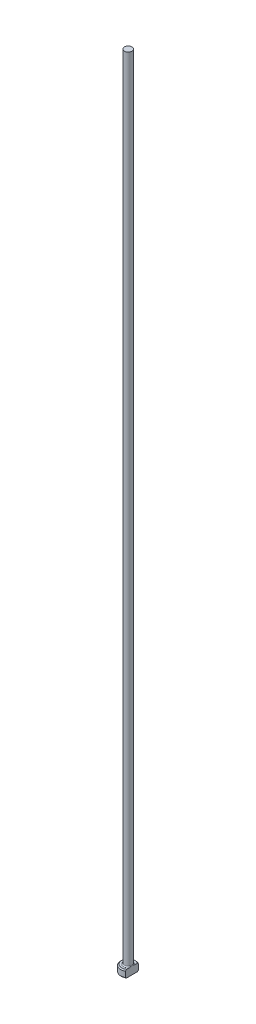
from build123d import *
from build123d.topology import SkipClean

# Parameters (mm, degrees)
CHAMFER1_SIZE = 0.2
FILLET1_R     = 0.2
KEY_DEPTH     = 161.014061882


with BuildPart() as part:
    # Sketch1 → Revolve1 (revolve)
    with BuildSketch(Plane.XY, mode=Mode.PRIVATE) as revolve1_sk:
        Polygon((0, 0), (-1.5, 0), (-1.5, 1.5), (-0.75, 1.5), (-0.75, 160), (0, 160), align=None)
    revolve(revolve1_sk.sketch.rotate(Axis((0, 259.958771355, 0), (0, -1, 0)), 270), axis=Axis((0, 259.958771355, 0), (0, -1, 0)))

    # Chamfer1
    chamfer1_edges = [part.edges().sort_by_distance(p)[0] for p in [
        (0, 1.5, -1.5),
        (0, 0, -1.5),
    ]]
    chamfer(chamfer1_edges, length=CHAMFER1_SIZE)

    # Fillet1
    fillet1_edges = [part.edges().sort_by_distance(p)[0] for p in [
        (0, 1.5, -0.75),
    ]]
    fillet(fillet1_edges, radius=FILLET1_R)

    # Sketch2 → KEY (cut, through all)
    with SkipClean():  # the faces are left unmerged after this step: merging them gives an invalid solid
        with BuildSketch(Plane(origin=(0, 0, 0), x_dir=(1, 0, 0), z_dir=(0, 1, 0))):
            with BuildLine():
                Line((0.75, 1.299038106), (0.75, -1.299038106))
                ThreePointArc((0.75, -1.299038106), (1.5, 0), (0.75, 1.299038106))
            make_face()
        extrude(amount=KEY_DEPTH, mode=Mode.SUBTRACT)


solid = part.part
